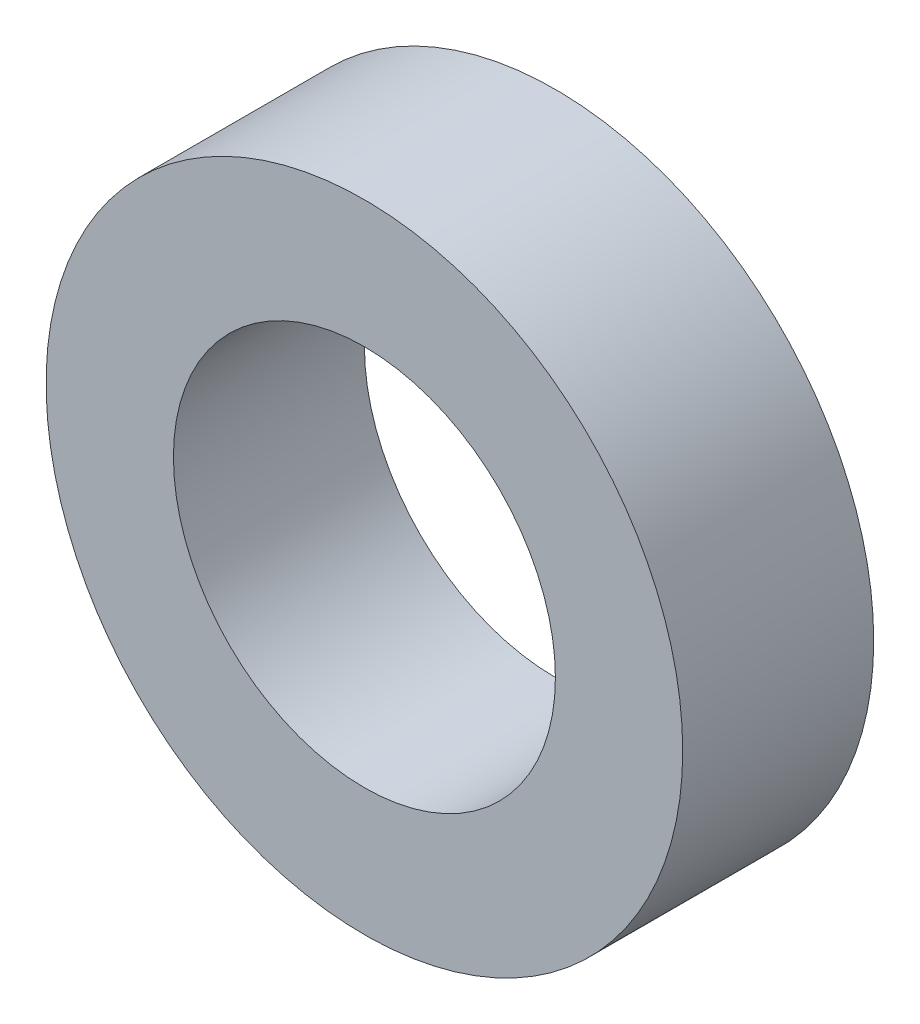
ISO-10303-21;
HEADER;
FILE_DESCRIPTION(('STEP AP214'),'2;1');
FILE_NAME('part.step','',(''),(''),'','','');
FILE_SCHEMA(('AUTOMOTIVE_DESIGN { 1 0 10303 214 1 1 1 1 }'));
ENDSEC;
DATA;
#1=APPLICATION_CONTEXT('core data for automotive mechanical design processes');
#2=APPLICATION_PROTOCOL_DEFINITION('international standard','automotive_design',2000,#1);
#3=PRODUCT_CONTEXT('',#1,'mechanical');
#4=PRODUCT('Part','Part','',(#3));
#5=PRODUCT_RELATED_PRODUCT_CATEGORY('part','',(#4));
#6=PRODUCT_DEFINITION_FORMATION('','',#4);
#7=PRODUCT_DEFINITION_CONTEXT('part definition',#1,'design');
#8=PRODUCT_DEFINITION('design','',#6,#7);
#9=PRODUCT_DEFINITION_SHAPE('','',#8);
#10=(LENGTH_UNIT() NAMED_UNIT(*) SI_UNIT(.MILLI.,.METRE.));
#11=(NAMED_UNIT(*) PLANE_ANGLE_UNIT() SI_UNIT($,.RADIAN.));
#12=(NAMED_UNIT(*) SI_UNIT($,.STERADIAN.) SOLID_ANGLE_UNIT());
#13=UNCERTAINTY_MEASURE_WITH_UNIT(LENGTH_MEASURE(1.E-05),#10,'distance_accuracy_value','');
#14=(GEOMETRIC_REPRESENTATION_CONTEXT(3) GLOBAL_UNCERTAINTY_ASSIGNED_CONTEXT((#13)) GLOBAL_UNIT_ASSIGNED_CONTEXT((#10,
#11,#12)) REPRESENTATION_CONTEXT('',''));
#15=CARTESIAN_POINT('',(0.,0.,0.));
#16=DIRECTION('',(0.,0.,1.));
#17=DIRECTION('',(1.,0.,0.));
#18=AXIS2_PLACEMENT_3D('',#15,#16,#17);
#19=CARTESIAN_POINT('',(0.,0.,8.57106781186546));
#20=DIRECTION('',(0.,0.,-1.));
#21=DIRECTION('',(-1.,0.,0.));
#22=AXIS2_PLACEMENT_3D('',#19,#20,#21);
#23=CYLINDRICAL_SURFACE('',#22,2.5);
#24=CARTESIAN_POINT('',(0.,0.,0.));
#25=DIRECTION('',(0.,0.,1.));
#26=DIRECTION('',(1.,0.,0.));
#27=AXIS2_PLACEMENT_3D('',#24,#25,#26);
#28=CIRCLE('',#27,2.5);
#29=CARTESIAN_POINT('',(2.5,0.,0.));
#30=VERTEX_POINT('',#29);
#31=EDGE_CURVE('E35',#30,#30,#28,.T.);
#32=ORIENTED_EDGE('',*,*,#31,.T.);
#33=EDGE_LOOP('',(#32));
#34=FACE_BOUND('',#33,.T.);
#35=CARTESIAN_POINT('',(0.,0.,1.49999999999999));
#36=DIRECTION('',(0.,0.,1.));
#37=DIRECTION('',(1.,0.,0.));
#38=AXIS2_PLACEMENT_3D('',#35,#36,#37);
#39=CIRCLE('',#38,2.5);
#40=CARTESIAN_POINT('',(2.5,0.,1.49999999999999));
#41=VERTEX_POINT('',#40);
#42=EDGE_CURVE('E10',#41,#41,#39,.T.);
#43=ORIENTED_EDGE('',*,*,#42,.F.);
#44=EDGE_LOOP('',(#43));
#45=FACE_BOUND('',#44,.T.);
#46=ADVANCED_FACE('F28',(#34,#45),#23,.T.);
#47=CARTESIAN_POINT('',(0.,0.,0.));
#48=DIRECTION('',(0.,0.,1.));
#49=DIRECTION('',(1.,0.,0.));
#50=AXIS2_PLACEMENT_3D('',#47,#48,#49);
#51=PLANE('',#50);
#52=ORIENTED_EDGE('',*,*,#31,.F.);
#53=EDGE_LOOP('',(#52));
#54=FACE_BOUND('',#53,.T.);
#55=CARTESIAN_POINT('',(0.,0.,0.));
#56=DIRECTION('',(0.,0.,1.));
#57=DIRECTION('',(1.,0.,0.));
#58=AXIS2_PLACEMENT_3D('',#55,#56,#57);
#59=CIRCLE('',#58,1.5);
#60=CARTESIAN_POINT('',(1.5,0.,0.));
#61=VERTEX_POINT('',#60);
#62=EDGE_CURVE('E40',#61,#61,#59,.T.);
#63=ORIENTED_EDGE('',*,*,#62,.T.);
#64=EDGE_LOOP('',(#63));
#65=FACE_BOUND('',#64,.T.);
#66=ADVANCED_FACE('F56',(#54,#65),#51,.F.);
#67=CARTESIAN_POINT('',(0.,0.,8.57106781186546));
#68=DIRECTION('',(0.,0.,-1.));
#69=DIRECTION('',(-1.,0.,0.));
#70=AXIS2_PLACEMENT_3D('',#67,#68,#69);
#71=CYLINDRICAL_SURFACE('',#70,1.5);
#72=ORIENTED_EDGE('',*,*,#62,.F.);
#73=EDGE_LOOP('',(#72));
#74=FACE_BOUND('',#73,.T.);
#75=CARTESIAN_POINT('',(0.,0.,1.49999999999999));
#76=DIRECTION('',(0.,0.,1.));
#77=DIRECTION('',(1.,0.,0.));
#78=AXIS2_PLACEMENT_3D('',#75,#76,#77);
#79=CIRCLE('',#78,1.5);
#80=CARTESIAN_POINT('',(1.5,0.,1.49999999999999));
#81=VERTEX_POINT('',#80);
#82=EDGE_CURVE('E31',#81,#81,#79,.T.);
#83=ORIENTED_EDGE('',*,*,#82,.T.);
#84=EDGE_LOOP('',(#83));
#85=FACE_BOUND('',#84,.T.);
#86=ADVANCED_FACE('F48',(#74,#85),#71,.F.);
#87=CARTESIAN_POINT('',(0.,0.,1.49999999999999));
#88=DIRECTION('',(0.,0.,1.));
#89=DIRECTION('',(1.,0.,0.));
#90=AXIS2_PLACEMENT_3D('',#87,#88,#89);
#91=PLANE('',#90);
#92=ORIENTED_EDGE('',*,*,#82,.F.);
#93=EDGE_LOOP('',(#92));
#94=FACE_BOUND('',#93,.T.);
#95=ORIENTED_EDGE('',*,*,#42,.T.);
#96=EDGE_LOOP('',(#95));
#97=FACE_BOUND('',#96,.T.);
#98=ADVANCED_FACE('F50',(#94,#97),#91,.T.);
#99=CLOSED_SHELL('',(#46,#66,#86,#98));
#100=MANIFOLD_SOLID_BREP('B2',#99);
#101=ADVANCED_BREP_SHAPE_REPRESENTATION('',(#18,#100),#14);
#102=SHAPE_DEFINITION_REPRESENTATION(#9,#101);
ENDSEC;
END-ISO-10303-21;
